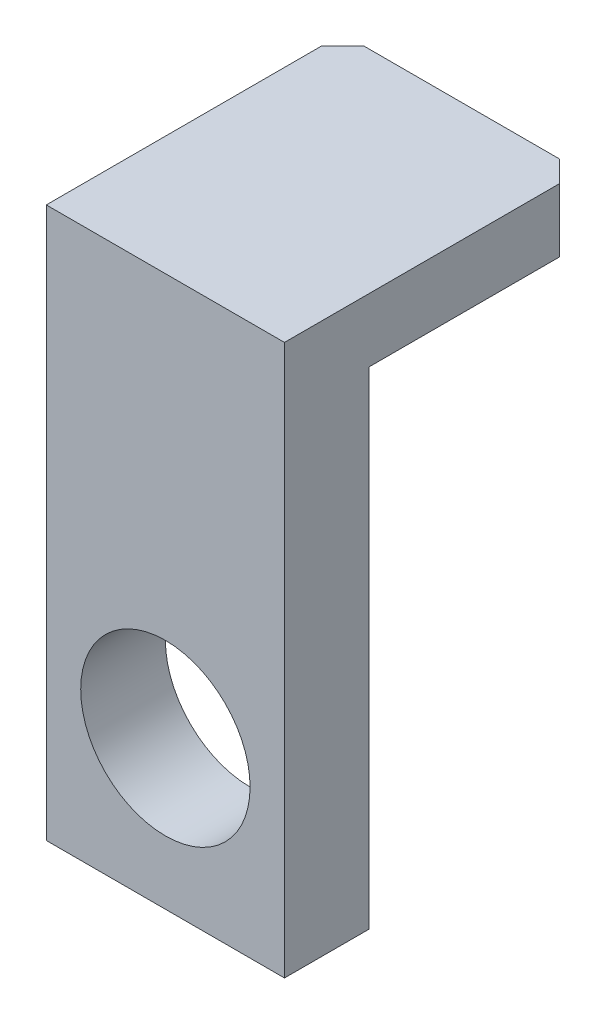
from build123d import *

# Parameters (mm, degrees)
ESQUISSE1_W      = 11.25
ESQUISSE1_H      = 26
ESQUISSE1_R      = 4
EXTRUSION1_DEPTH = 4
ESQUISSE2_W      = 11.25
ESQUISSE2_H      = 3
EXTRUSION2_DEPTH = 10
CHANFREIN1_SIZE  = 1


with BuildPart() as part:
    # Esquisse1 → Extrusion1 (new body)
    with BuildSketch(Plane.XY):
        with Locations((5.625, 13)):
            Rectangle(ESQUISSE1_W, ESQUISSE1_H)
        with Locations((5.625, 7)):
            Circle(ESQUISSE1_R, mode=Mode.SUBTRACT)
    extrude(amount=EXTRUSION1_DEPTH)

    # Esquisse2 → Extrusion2 (add)
    with BuildSketch(Plane(origin=(0, 0, 0), x_dir=(-1, 0, 0), z_dir=(0, 0, -1))):
        with Locations((-5.625, 24.5)):
            Rectangle(ESQUISSE2_W, ESQUISSE2_H)
    extrude(amount=EXTRUSION2_DEPTH)

    # Chanfrein1
    chanfrein1_edges = [part.edges().sort_by_distance(p)[0] for p in [
        (0, 24.5, -10),
        (11.25, 24.5, -10),
    ]]
    chamfer(chanfrein1_edges, length=CHANFREIN1_SIZE)


solid = part.part
